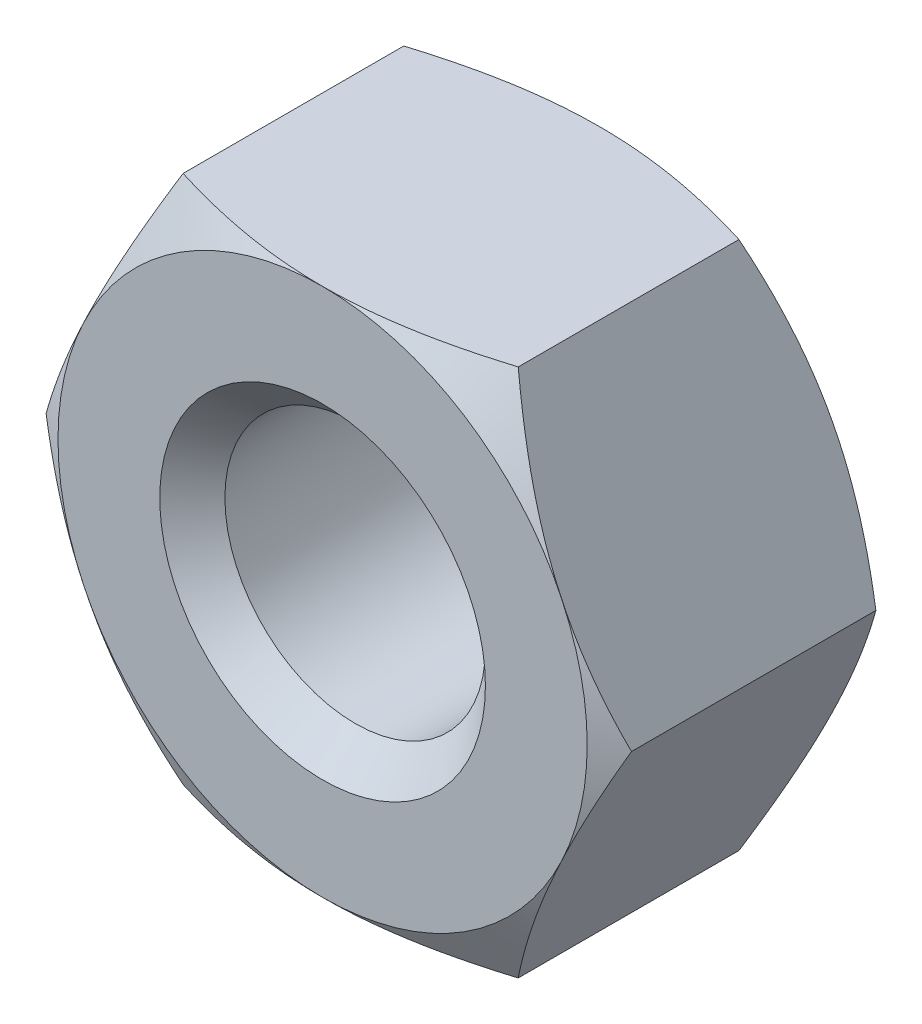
from build123d import *

# Parameters (mm, degrees)
BASE_EXTRUSION_DEPTH    = 6.8
ESQUISSE4_R             = 3.2
ENL_V_MAT_EXTRU_1_DEPTH = 12.840021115
CHANFREIN1_SIZE         = 0.8


with BuildPart() as part:
    # Esquisse1 → Base-Extrusion (new body)
    with BuildSketch(Plane.XY):
        Polygon((-7.19, 0), (-4.116549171, 6.5), (4.116549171, 6.5), (7.19, 0), (4.116549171, -6.5), (-4.116549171, -6.5), align=None)
    extrude(amount=BASE_EXTRUSION_DEPTH)

    # Esquisse3 → Enlever de la mati_re-R_volution1 (revolve, cut)
    with BuildSketch(Plane(origin=(0, 0, 0), x_dir=(0, 0, -1), z_dir=(1, 0, 0)), mode=Mode.PRIVATE) as enlever_de_la_mati_re_r_volution1_sk:
        Polygon((-6.8, 6.5), (-3.4, 12.388972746), (0, 6.5), (2.598076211, 8), (-3.4, 18.388972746), (-9.398076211, 8), align=None)
    revolve(enlever_de_la_mati_re_r_volution1_sk.sketch.rotate(Axis((0, 0, 8.495961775), (0, 0, -1)), 90), axis=Axis((0, 0, 8.495961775), (0, 0, -1)), mode=Mode.SUBTRACT)

    # Esquisse4 → Enl_v. mat.-Extru.1 (cut, through all)
    with BuildSketch(Plane.XY.offset(6.8)):
        Circle(ESQUISSE4_R)
    extrude(amount=-ENL_V_MAT_EXTRU_1_DEPTH, mode=Mode.SUBTRACT)

    # Chanfrein1
    chanfrein1_edges = [part.edges().sort_by_distance(p)[0] for p in [
        (-3.2, 0, 0),
        (-3.2, 0, 6.8),
    ]]
    chamfer(chanfrein1_edges, length=CHANFREIN1_SIZE)


solid = part.part
